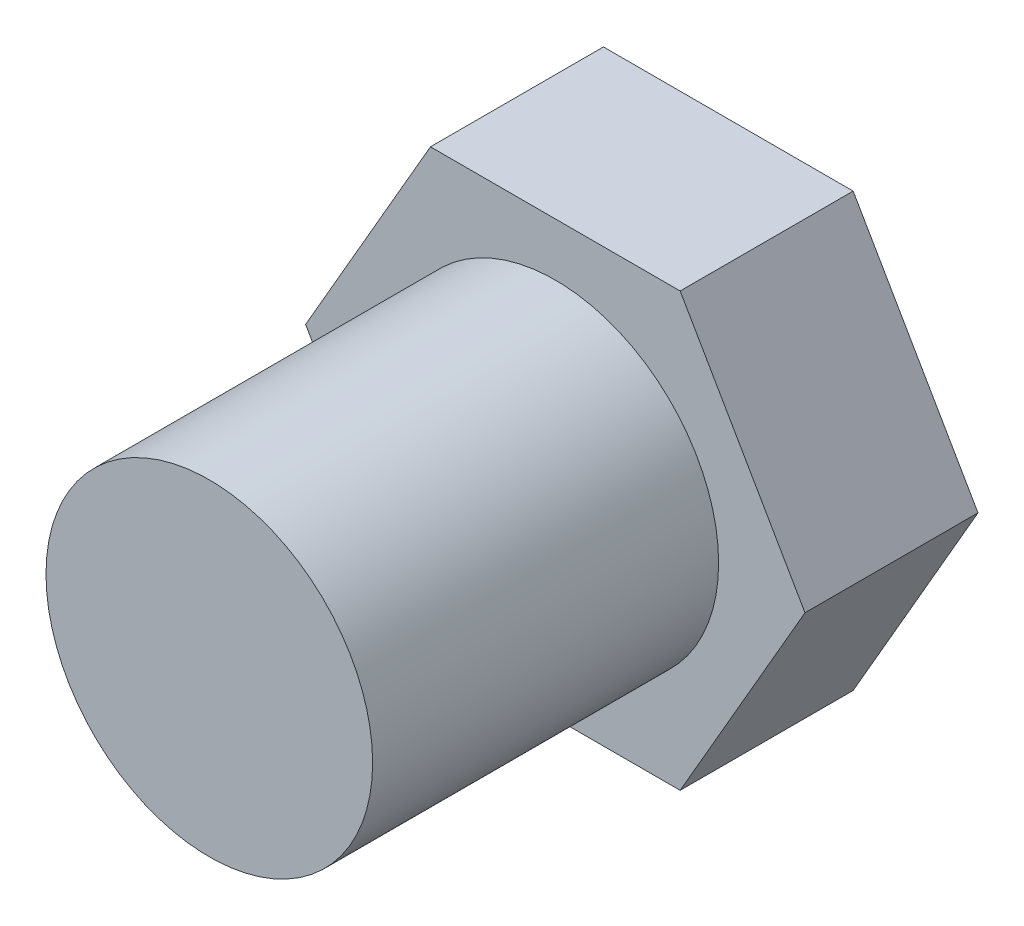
ISO-10303-21;
HEADER;
FILE_DESCRIPTION(('STEP AP214'),'2;1');
FILE_NAME('part.step','',(''),(''),'','','');
FILE_SCHEMA(('AUTOMOTIVE_DESIGN { 1 0 10303 214 1 1 1 1 }'));
ENDSEC;
DATA;
#1=APPLICATION_CONTEXT('core data for automotive mechanical design processes');
#2=APPLICATION_PROTOCOL_DEFINITION('international standard','automotive_design',2000,#1);
#3=PRODUCT_CONTEXT('',#1,'mechanical');
#4=PRODUCT('Part','Part','',(#3));
#5=PRODUCT_RELATED_PRODUCT_CATEGORY('part','',(#4));
#6=PRODUCT_DEFINITION_FORMATION('','',#4);
#7=PRODUCT_DEFINITION_CONTEXT('part definition',#1,'design');
#8=PRODUCT_DEFINITION('design','',#6,#7);
#9=PRODUCT_DEFINITION_SHAPE('','',#8);
#10=(LENGTH_UNIT() NAMED_UNIT(*) SI_UNIT(.MILLI.,.METRE.));
#11=(NAMED_UNIT(*) PLANE_ANGLE_UNIT() SI_UNIT($,.RADIAN.));
#12=(NAMED_UNIT(*) SI_UNIT($,.STERADIAN.) SOLID_ANGLE_UNIT());
#13=UNCERTAINTY_MEASURE_WITH_UNIT(LENGTH_MEASURE(1.E-05),#10,'distance_accuracy_value','');
#14=(GEOMETRIC_REPRESENTATION_CONTEXT(3) GLOBAL_UNCERTAINTY_ASSIGNED_CONTEXT((#13)) GLOBAL_UNIT_ASSIGNED_CONTEXT((#10,
#11,#12)) REPRESENTATION_CONTEXT('',''));
#15=CARTESIAN_POINT('',(0.,0.,0.));
#16=DIRECTION('',(0.,0.,1.));
#17=DIRECTION('',(1.,0.,0.));
#18=AXIS2_PLACEMENT_3D('',#15,#16,#17);
#19=CARTESIAN_POINT('',(0.,0.,12.7));
#20=DIRECTION('',(0.,0.,-1.));
#21=DIRECTION('',(-1.,0.,0.));
#22=AXIS2_PLACEMENT_3D('',#19,#20,#21);
#23=CYLINDRICAL_SURFACE('',#22,5.9944);
#24=CARTESIAN_POINT('',(0.,0.,12.7));
#25=DIRECTION('',(0.,0.,1.));
#26=DIRECTION('',(1.,0.,0.));
#27=AXIS2_PLACEMENT_3D('',#24,#25,#26);
#28=CIRCLE('',#27,5.9944);
#29=CARTESIAN_POINT('',(5.9944,0.,12.7));
#30=VERTEX_POINT('',#29);
#31=EDGE_CURVE('E11',#30,#30,#28,.T.);
#32=ORIENTED_EDGE('',*,*,#31,.F.);
#33=EDGE_LOOP('',(#32));
#34=FACE_BOUND('',#33,.T.);
#35=CARTESIAN_POINT('',(0.,0.,0.));
#36=DIRECTION('',(0.,0.,-1.));
#37=DIRECTION('',(-1.,0.,0.));
#38=AXIS2_PLACEMENT_3D('',#35,#36,#37);
#39=CIRCLE('',#38,5.9944);
#40=CARTESIAN_POINT('',(-5.9944,0.,0.));
#41=VERTEX_POINT('',#40);
#42=EDGE_CURVE('E42',#41,#41,#39,.T.);
#43=ORIENTED_EDGE('',*,*,#42,.F.);
#44=EDGE_LOOP('',(#43));
#45=FACE_BOUND('',#44,.T.);
#46=ADVANCED_FACE('F34',(#34,#45),#23,.T.);
#47=CARTESIAN_POINT('',(0.,0.,12.7));
#48=DIRECTION('',(0.,0.,1.));
#49=DIRECTION('',(1.,0.,0.));
#50=AXIS2_PLACEMENT_3D('',#47,#48,#49);
#51=PLANE('',#50);
#52=ORIENTED_EDGE('',*,*,#31,.T.);
#53=EDGE_LOOP('',(#52));
#54=FACE_BOUND('',#53,.T.);
#55=ADVANCED_FACE('F143',(#54),#51,.T.);
#56=CARTESIAN_POINT('',(0.,0.,0.));
#57=DIRECTION('',(0.,0.,-1.));
#58=DIRECTION('',(-1.,0.,0.));
#59=AXIS2_PLACEMENT_3D('',#56,#57,#58);
#60=PLANE('',#59);
#61=DIRECTION('',(-0.5,0.866025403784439,0.));
#62=VECTOR('',#61,1.);
#63=CARTESIAN_POINT('',(-4.58271776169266,-7.93750000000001,0.));
#64=LINE('',#63,#62);
#65=CARTESIAN_POINT('',(-4.58271776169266,-7.93750000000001,0.));
#66=VERTEX_POINT('',#65);
#67=CARTESIAN_POINT('',(-9.16543552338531,0.,0.));
#68=VERTEX_POINT('',#67);
#69=EDGE_CURVE('E119',#66,#68,#64,.T.);
#70=ORIENTED_EDGE('',*,*,#69,.F.);
#71=DIRECTION('',(-1.,0.,0.));
#72=VECTOR('',#71,1.);
#73=CARTESIAN_POINT('',(4.58271776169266,-7.93750000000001,0.));
#74=LINE('',#73,#72);
#75=CARTESIAN_POINT('',(4.58271776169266,-7.93750000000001,0.));
#76=VERTEX_POINT('',#75);
#77=EDGE_CURVE('E79',#76,#66,#74,.T.);
#78=ORIENTED_EDGE('',*,*,#77,.F.);
#79=DIRECTION('',(-0.5,-0.866025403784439,0.));
#80=VECTOR('',#79,1.);
#81=CARTESIAN_POINT('',(9.16543552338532,0.,0.));
#82=LINE('',#81,#80);
#83=CARTESIAN_POINT('',(9.16543552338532,0.,0.));
#84=VERTEX_POINT('',#83);
#85=EDGE_CURVE('E73',#84,#76,#82,.T.);
#86=ORIENTED_EDGE('',*,*,#85,.F.);
#87=DIRECTION('',(0.5,-0.866025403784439,0.));
#88=VECTOR('',#87,1.);
#89=CARTESIAN_POINT('',(4.58271776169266,7.93750000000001,0.));
#90=LINE('',#89,#88);
#91=CARTESIAN_POINT('',(4.58271776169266,7.93750000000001,0.));
#92=VERTEX_POINT('',#91);
#93=EDGE_CURVE('E109',#92,#84,#90,.T.);
#94=ORIENTED_EDGE('',*,*,#93,.F.);
#95=DIRECTION('',(1.,0.,0.));
#96=VECTOR('',#95,1.);
#97=CARTESIAN_POINT('',(-4.58271776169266,7.93750000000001,0.));
#98=LINE('',#97,#96);
#99=CARTESIAN_POINT('',(-4.58271776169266,7.93750000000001,0.));
#100=VERTEX_POINT('',#99);
#101=EDGE_CURVE('E124',#100,#92,#98,.T.);
#102=ORIENTED_EDGE('',*,*,#101,.F.);
#103=DIRECTION('',(0.5,0.866025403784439,0.));
#104=VECTOR('',#103,1.);
#105=CARTESIAN_POINT('',(-9.16543552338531,0.,0.));
#106=LINE('',#105,#104);
#107=EDGE_CURVE('E122',#68,#100,#106,.T.);
#108=ORIENTED_EDGE('',*,*,#107,.F.);
#109=EDGE_LOOP('',(#70,#78,#86,#94,#102,#108));
#110=FACE_BOUND('',#109,.T.);
#111=ORIENTED_EDGE('',*,*,#42,.T.);
#112=EDGE_LOOP('',(#111));
#113=FACE_BOUND('',#112,.T.);
#114=ADVANCED_FACE('F140',(#110,#113),#60,.F.);
#115=CARTESIAN_POINT('',(-4.58271776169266,-7.93750000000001,-6.35));
#116=DIRECTION('',(0.866025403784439,0.5,0.));
#117=DIRECTION('',(-0.5,0.866025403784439,0.));
#118=AXIS2_PLACEMENT_3D('',#115,#116,#117);
#119=PLANE('',#118);
#120=ORIENTED_EDGE('',*,*,#69,.T.);
#121=DIRECTION('',(0.,0.,1.));
#122=VECTOR('',#121,1.);
#123=CARTESIAN_POINT('',(-9.16543552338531,0.,-6.35));
#124=LINE('',#123,#122);
#125=CARTESIAN_POINT('',(-9.16543552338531,0.,-6.35));
#126=VERTEX_POINT('',#125);
#127=EDGE_CURVE('E136',#126,#68,#124,.T.);
#128=ORIENTED_EDGE('',*,*,#127,.F.);
#129=DIRECTION('',(-0.5,0.866025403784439,0.));
#130=VECTOR('',#129,1.);
#131=CARTESIAN_POINT('',(-4.58271776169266,-7.93750000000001,-6.35));
#132=LINE('',#131,#130);
#133=CARTESIAN_POINT('',(-4.58271776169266,-7.93750000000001,-6.35));
#134=VERTEX_POINT('',#133);
#135=EDGE_CURVE('E129',#134,#126,#132,.T.);
#136=ORIENTED_EDGE('',*,*,#135,.F.);
#137=DIRECTION('',(0.,0.,1.));
#138=VECTOR('',#137,1.);
#139=CARTESIAN_POINT('',(-4.58271776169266,-7.93750000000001,-6.35));
#140=LINE('',#139,#138);
#141=EDGE_CURVE('E115',#134,#66,#140,.T.);
#142=ORIENTED_EDGE('',*,*,#141,.T.);
#143=EDGE_LOOP('',(#120,#128,#136,#142));
#144=FACE_BOUND('',#143,.T.);
#145=ADVANCED_FACE('F153',(#144),#119,.F.);
#146=CARTESIAN_POINT('',(-9.16543552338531,0.,-6.35));
#147=DIRECTION('',(0.866025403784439,-0.5,0.));
#148=DIRECTION('',(0.5,0.866025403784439,0.));
#149=AXIS2_PLACEMENT_3D('',#146,#147,#148);
#150=PLANE('',#149);
#151=ORIENTED_EDGE('',*,*,#107,.T.);
#152=DIRECTION('',(0.,0.,1.));
#153=VECTOR('',#152,1.);
#154=CARTESIAN_POINT('',(-4.58271776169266,7.93750000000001,-6.35));
#155=LINE('',#154,#153);
#156=CARTESIAN_POINT('',(-4.58271776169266,7.93750000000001,-6.35));
#157=VERTEX_POINT('',#156);
#158=EDGE_CURVE('E133',#157,#100,#155,.T.);
#159=ORIENTED_EDGE('',*,*,#158,.F.);
#160=DIRECTION('',(0.5,0.866025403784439,0.));
#161=VECTOR('',#160,1.);
#162=CARTESIAN_POINT('',(-9.16543552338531,0.,-6.35));
#163=LINE('',#162,#161);
#164=EDGE_CURVE('E88',#126,#157,#163,.T.);
#165=ORIENTED_EDGE('',*,*,#164,.F.);
#166=ORIENTED_EDGE('',*,*,#127,.T.);
#167=EDGE_LOOP('',(#151,#159,#165,#166));
#168=FACE_BOUND('',#167,.T.);
#169=ADVANCED_FACE('F159',(#168),#150,.F.);
#170=CARTESIAN_POINT('',(-4.58271776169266,7.93750000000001,-6.35));
#171=DIRECTION('',(0.,-1.,0.));
#172=DIRECTION('',(1.,0.,0.));
#173=AXIS2_PLACEMENT_3D('',#170,#171,#172);
#174=PLANE('',#173);
#175=ORIENTED_EDGE('',*,*,#101,.T.);
#176=DIRECTION('',(0.,0.,1.));
#177=VECTOR('',#176,1.);
#178=CARTESIAN_POINT('',(4.58271776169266,7.93750000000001,-6.35));
#179=LINE('',#178,#177);
#180=CARTESIAN_POINT('',(4.58271776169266,7.93750000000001,-6.35));
#181=VERTEX_POINT('',#180);
#182=EDGE_CURVE('E110',#181,#92,#179,.T.);
#183=ORIENTED_EDGE('',*,*,#182,.F.);
#184=DIRECTION('',(1.,0.,0.));
#185=VECTOR('',#184,1.);
#186=CARTESIAN_POINT('',(-4.58271776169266,7.93750000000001,-6.35));
#187=LINE('',#186,#185);
#188=EDGE_CURVE('E101',#157,#181,#187,.T.);
#189=ORIENTED_EDGE('',*,*,#188,.F.);
#190=ORIENTED_EDGE('',*,*,#158,.T.);
#191=EDGE_LOOP('',(#175,#183,#189,#190));
#192=FACE_BOUND('',#191,.T.);
#193=ADVANCED_FACE('F163',(#192),#174,.F.);
#194=CARTESIAN_POINT('',(4.58271776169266,7.93750000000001,-6.35));
#195=DIRECTION('',(-0.866025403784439,-0.5,0.));
#196=DIRECTION('',(0.5,-0.866025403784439,0.));
#197=AXIS2_PLACEMENT_3D('',#194,#195,#196);
#198=PLANE('',#197);
#199=ORIENTED_EDGE('',*,*,#93,.T.);
#200=DIRECTION('',(0.,0.,1.));
#201=VECTOR('',#200,1.);
#202=CARTESIAN_POINT('',(9.16543552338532,0.,-6.35));
#203=LINE('',#202,#201);
#204=CARTESIAN_POINT('',(9.16543552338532,0.,-6.35));
#205=VERTEX_POINT('',#204);
#206=EDGE_CURVE('E106',#205,#84,#203,.T.);
#207=ORIENTED_EDGE('',*,*,#206,.F.);
#208=DIRECTION('',(0.5,-0.866025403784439,0.));
#209=VECTOR('',#208,1.);
#210=CARTESIAN_POINT('',(4.58271776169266,7.93750000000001,-6.35));
#211=LINE('',#210,#209);
#212=EDGE_CURVE('E95',#181,#205,#211,.T.);
#213=ORIENTED_EDGE('',*,*,#212,.F.);
#214=ORIENTED_EDGE('',*,*,#182,.T.);
#215=EDGE_LOOP('',(#199,#207,#213,#214));
#216=FACE_BOUND('',#215,.T.);
#217=ADVANCED_FACE('F107',(#216),#198,.F.);
#218=CARTESIAN_POINT('',(9.16543552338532,0.,-6.35));
#219=DIRECTION('',(-0.866025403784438,0.5,0.));
#220=DIRECTION('',(-0.5,-0.866025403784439,0.));
#221=AXIS2_PLACEMENT_3D('',#218,#219,#220);
#222=PLANE('',#221);
#223=ORIENTED_EDGE('',*,*,#85,.T.);
#224=DIRECTION('',(0.,0.,1.));
#225=VECTOR('',#224,1.);
#226=CARTESIAN_POINT('',(4.58271776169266,-7.93750000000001,-6.35));
#227=LINE('',#226,#225);
#228=CARTESIAN_POINT('',(4.58271776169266,-7.93750000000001,-6.35));
#229=VERTEX_POINT('',#228);
#230=EDGE_CURVE('E111',#229,#76,#227,.T.);
#231=ORIENTED_EDGE('',*,*,#230,.F.);
#232=DIRECTION('',(-0.5,-0.866025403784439,0.));
#233=VECTOR('',#232,1.);
#234=CARTESIAN_POINT('',(9.16543552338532,0.,-6.35));
#235=LINE('',#234,#233);
#236=EDGE_CURVE('E99',#205,#229,#235,.T.);
#237=ORIENTED_EDGE('',*,*,#236,.F.);
#238=ORIENTED_EDGE('',*,*,#206,.T.);
#239=EDGE_LOOP('',(#223,#231,#237,#238));
#240=FACE_BOUND('',#239,.T.);
#241=ADVANCED_FACE('F113',(#240),#222,.F.);
#242=CARTESIAN_POINT('',(4.58271776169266,-7.93750000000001,-6.35));
#243=DIRECTION('',(0.,1.,0.));
#244=DIRECTION('',(0.,0.,1.));
#245=AXIS2_PLACEMENT_3D('',#242,#243,#244);
#246=PLANE('',#245);
#247=ORIENTED_EDGE('',*,*,#77,.T.);
#248=ORIENTED_EDGE('',*,*,#141,.F.);
#249=DIRECTION('',(-1.,0.,0.));
#250=VECTOR('',#249,1.);
#251=CARTESIAN_POINT('',(4.58271776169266,-7.93750000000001,-6.35));
#252=LINE('',#251,#250);
#253=EDGE_CURVE('E50',#229,#134,#252,.T.);
#254=ORIENTED_EDGE('',*,*,#253,.F.);
#255=ORIENTED_EDGE('',*,*,#230,.T.);
#256=EDGE_LOOP('',(#247,#248,#254,#255));
#257=FACE_BOUND('',#256,.T.);
#258=ADVANCED_FACE('F171',(#257),#246,.F.);
#259=CARTESIAN_POINT('',(0.,0.,-6.35));
#260=DIRECTION('',(0.,0.,-1.));
#261=DIRECTION('',(-1.,0.,0.));
#262=AXIS2_PLACEMENT_3D('',#259,#260,#261);
#263=PLANE('',#262);
#264=ORIENTED_EDGE('',*,*,#135,.T.);
#265=ORIENTED_EDGE('',*,*,#164,.T.);
#266=ORIENTED_EDGE('',*,*,#188,.T.);
#267=ORIENTED_EDGE('',*,*,#212,.T.);
#268=ORIENTED_EDGE('',*,*,#236,.T.);
#269=ORIENTED_EDGE('',*,*,#253,.T.);
#270=EDGE_LOOP('',(#264,#265,#266,#267,#268,#269));
#271=FACE_BOUND('',#270,.T.);
#272=ADVANCED_FACE('F97',(#271),#263,.T.);
#273=CLOSED_SHELL('',(#46,#55,#114,#145,#169,#193,#217,#241,#258,#272));
#274=MANIFOLD_SOLID_BREP('B2',#273);
#275=ADVANCED_BREP_SHAPE_REPRESENTATION('',(#18,#274),#14);
#276=SHAPE_DEFINITION_REPRESENTATION(#9,#275);
ENDSEC;
END-ISO-10303-21;
